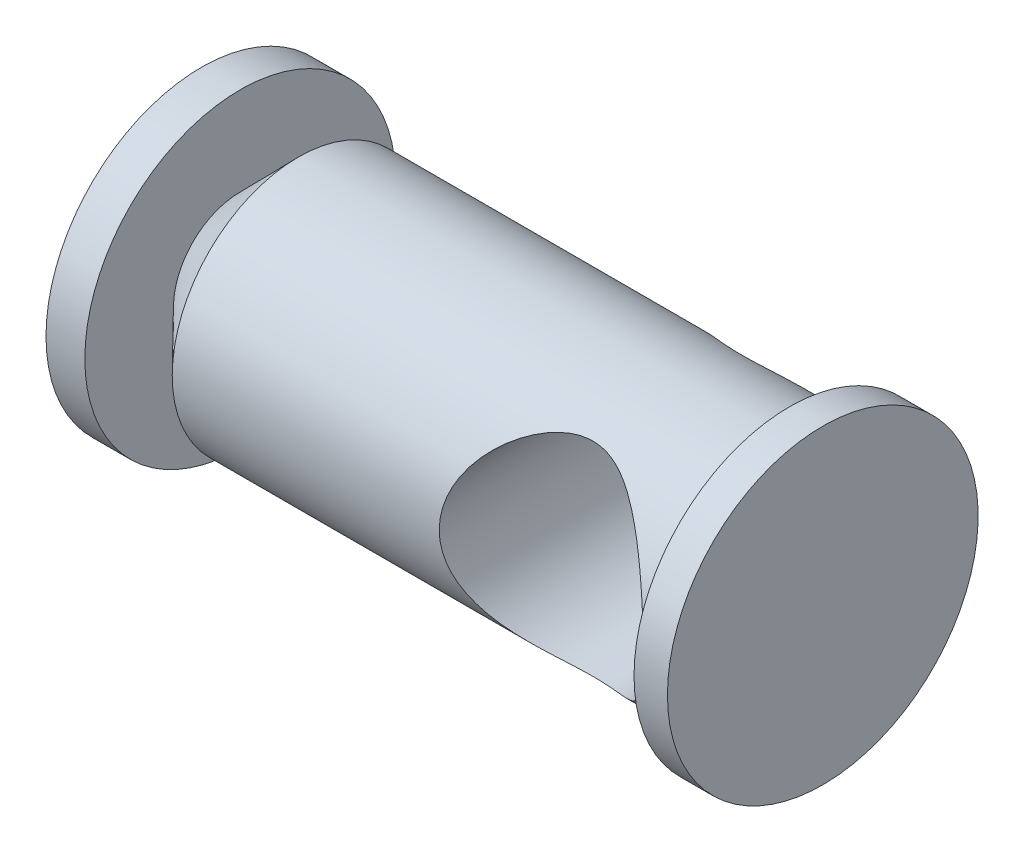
from build123d import *

# Parameters (mm, degrees)
ENL_V_MAT_EXTRU_1_DEPTH      = 4
ENL_V_MAT_EXTRU_1_DEPTH_BACK = 12.35
ESQUISSE3_R                  = 5.25


with BuildPart() as part:
    # Esquisse2 → Base-R_volution (revolve)
    with BuildSketch(Plane.XY, mode=Mode.PRIVATE) as base_r_volution_sk:
        Polygon((-60, 8), (-58, 8), (-58, 3.44), (-55, 6.5), (-29.72, 6.5), (-29.72, 8), (-28, 8), (-28, 0), (-42.24, 0), (-42.24, 3), (-60, 3), align=None)
    revolve(base_r_volution_sk.sketch.rotate(Axis((-90, 0, 0), (1, 0, 0)), 90), axis=Axis((-90, 0, 0), (1, 0, 0)))

    # Esquisse3 → Enl_v. mat.-Extru.1 (cut, two sides: drawn at the far end of the back side and taken through both)
    with BuildSketch(Plane.XY.offset(7).offset(-ENL_V_MAT_EXTRU_1_DEPTH_BACK)):
        with Locations((-36, 0)):
            Circle(ESQUISSE3_R)
    extrude(amount=ENL_V_MAT_EXTRU_1_DEPTH + ENL_V_MAT_EXTRU_1_DEPTH_BACK, mode=Mode.SUBTRACT)


solid = part.part
